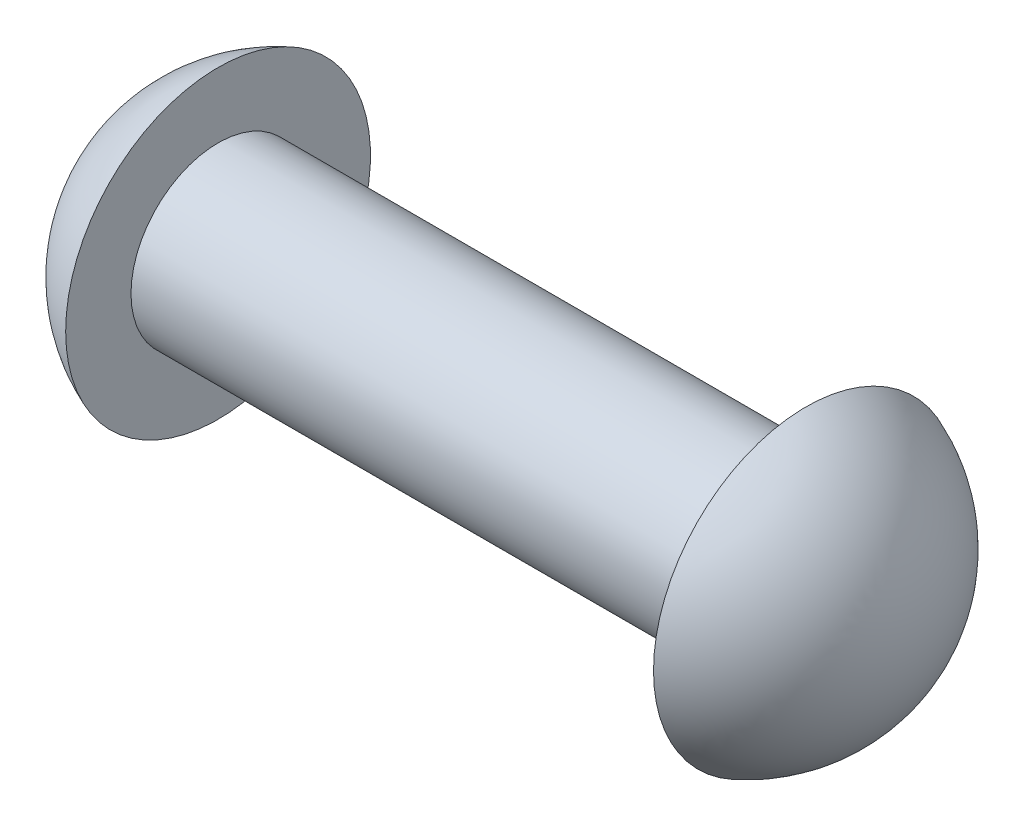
ISO-10303-21;
HEADER;
FILE_DESCRIPTION(('STEP AP214'),'2;1');
FILE_NAME('part.step','',(''),(''),'','','');
FILE_SCHEMA(('AUTOMOTIVE_DESIGN { 1 0 10303 214 1 1 1 1 }'));
ENDSEC;
DATA;
#1=APPLICATION_CONTEXT('core data for automotive mechanical design processes');
#2=APPLICATION_PROTOCOL_DEFINITION('international standard','automotive_design',2000,#1);
#3=PRODUCT_CONTEXT('',#1,'mechanical');
#4=PRODUCT('Part','Part','',(#3));
#5=PRODUCT_RELATED_PRODUCT_CATEGORY('part','',(#4));
#6=PRODUCT_DEFINITION_FORMATION('','',#4);
#7=PRODUCT_DEFINITION_CONTEXT('part definition',#1,'design');
#8=PRODUCT_DEFINITION('design','',#6,#7);
#9=PRODUCT_DEFINITION_SHAPE('','',#8);
#10=(LENGTH_UNIT() NAMED_UNIT(*) SI_UNIT(.MILLI.,.METRE.));
#11=(NAMED_UNIT(*) PLANE_ANGLE_UNIT() SI_UNIT($,.RADIAN.));
#12=(NAMED_UNIT(*) SI_UNIT($,.STERADIAN.) SOLID_ANGLE_UNIT());
#13=UNCERTAINTY_MEASURE_WITH_UNIT(LENGTH_MEASURE(1.E-05),#10,'distance_accuracy_value','');
#14=(GEOMETRIC_REPRESENTATION_CONTEXT(3) GLOBAL_UNCERTAINTY_ASSIGNED_CONTEXT((#13)) GLOBAL_UNIT_ASSIGNED_CONTEXT((#10,
#11,#12)) REPRESENTATION_CONTEXT('',''));
#15=CARTESIAN_POINT('',(0.,0.,0.));
#16=DIRECTION('',(0.,0.,1.));
#17=DIRECTION('',(1.,0.,0.));
#18=AXIS2_PLACEMENT_3D('',#15,#16,#17);
#19=CARTESIAN_POINT('',(-39.,0.,0.));
#20=DIRECTION('',(-1.,0.,0.));
#21=DIRECTION('',(0.,0.,1.));
#22=AXIS2_PLACEMENT_3D('',#19,#20,#21);
#23=CYLINDRICAL_SURFACE('',#22,4.);
#24=CARTESIAN_POINT('',(-27.,0.,0.));
#25=DIRECTION('',(-1.,0.,0.));
#26=DIRECTION('',(0.,0.,1.));
#27=AXIS2_PLACEMENT_3D('',#24,#25,#26);
#28=CIRCLE('',#27,4.);
#29=CARTESIAN_POINT('',(-27.,0.,4.));
#30=VERTEX_POINT('',#29);
#31=EDGE_CURVE('E11',#30,#30,#28,.T.);
#32=ORIENTED_EDGE('',*,*,#31,.F.);
#33=EDGE_LOOP('',(#32));
#34=FACE_BOUND('',#33,.T.);
#35=CARTESIAN_POINT('',(0.,0.,0.));
#36=DIRECTION('',(1.,0.,0.));
#37=DIRECTION('',(0.,0.,-1.));
#38=AXIS2_PLACEMENT_3D('',#35,#36,#37);
#39=CIRCLE('',#38,4.);
#40=CARTESIAN_POINT('',(0.,0.,-4.));
#41=VERTEX_POINT('',#40);
#42=EDGE_CURVE('E68',#41,#41,#39,.T.);
#43=ORIENTED_EDGE('',*,*,#42,.F.);
#44=EDGE_LOOP('',(#43));
#45=FACE_BOUND('',#44,.T.);
#46=ADVANCED_FACE('F32',(#34,#45),#23,.T.);
#47=CARTESIAN_POINT('',(-27.,4.,0.));
#48=DIRECTION('',(-1.,0.,0.));
#49=DIRECTION('',(0.,0.,1.));
#50=AXIS2_PLACEMENT_3D('',#47,#48,#49);
#51=PLANE('',#50);
#52=CARTESIAN_POINT('',(-27.,0.,0.));
#53=DIRECTION('',(-1.,0.,0.));
#54=DIRECTION('',(0.,0.,1.));
#55=AXIS2_PLACEMENT_3D('',#52,#53,#54);
#56=CIRCLE('',#55,7.);
#57=CARTESIAN_POINT('',(-27.,0.,7.));
#58=VERTEX_POINT('',#57);
#59=EDGE_CURVE('E39',#58,#58,#56,.T.);
#60=ORIENTED_EDGE('',*,*,#59,.F.);
#61=EDGE_LOOP('',(#60));
#62=FACE_BOUND('',#61,.T.);
#63=ORIENTED_EDGE('',*,*,#31,.T.);
#64=EDGE_LOOP('',(#63));
#65=FACE_BOUND('',#64,.T.);
#66=ADVANCED_FACE('F58',(#62,#65),#51,.F.);
#67=CARTESIAN_POINT('',(-24.3000005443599,0.,0.00285751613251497));
#68=DIRECTION('',(0.,-1.,0.));
#69=DIRECTION('',(0.,0.,1.));
#70=AXIS2_PLACEMENT_3D('',#67,#68,#69);
#71=CIRCLE('',#70,7.5);
#72=TRIMMED_CURVE('',#71,(PARAMETER_VALUE(-1.57117732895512)),
(PARAMETER_VALUE(1.57117732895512)),.T.,.PARAMETER.);
#73=CARTESIAN_POINT('',(-24.3000005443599,0.,0.));
#74=DIRECTION('',(-1.,0.,0.));
#75=AXIS1_PLACEMENT('',#73,#74);
#76=SURFACE_OF_REVOLUTION('',#72,#75);
#77=CARTESIAN_POINT('',(-31.8,0.,0.));
#78=VERTEX_POINT('',#77);
#79=VERTEX_LOOP('',#78);
#80=FACE_BOUND('',#79,.T.);
#81=ORIENTED_EDGE('',*,*,#59,.T.);
#82=EDGE_LOOP('',(#81));
#83=FACE_BOUND('',#82,.T.);
#84=ADVANCED_FACE('F53',(#80,#83),#76,.T.);
#85=CARTESIAN_POINT('',(0.,0.,0.));
#86=DIRECTION('',(1.,0.,0.));
#87=DIRECTION('',(0.,0.,-1.));
#88=AXIS2_PLACEMENT_3D('',#85,#86,#87);
#89=PLANE('',#88);
#90=ORIENTED_EDGE('',*,*,#42,.T.);
#91=EDGE_LOOP('',(#90));
#92=FACE_BOUND('',#91,.T.);
#93=CARTESIAN_POINT('',(0.,0.,0.));
#94=DIRECTION('',(-1.,0.,0.));
#95=DIRECTION('',(0.,0.,1.));
#96=AXIS2_PLACEMENT_3D('',#93,#94,#95);
#97=CIRCLE('',#96,7.);
#98=CARTESIAN_POINT('',(0.,0.,7.));
#99=VERTEX_POINT('',#98);
#100=EDGE_CURVE('E69',#99,#99,#97,.T.);
#101=ORIENTED_EDGE('',*,*,#100,.T.);
#102=EDGE_LOOP('',(#101));
#103=FACE_BOUND('',#102,.T.);
#104=ADVANCED_FACE('F47',(#92,#103),#89,.F.);
#105=CARTESIAN_POINT('',(-2.69999945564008,0.,0.00285751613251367));
#106=DIRECTION('',(0.,-1.,0.));
#107=DIRECTION('',(0.,0.,1.));
#108=AXIS2_PLACEMENT_3D('',#105,#106,#107);
#109=CIRCLE('',#108,7.5);
#110=TRIMMED_CURVE('',#109,(PARAMETER_VALUE(-1.57117732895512)),
(PARAMETER_VALUE(1.57117732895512)),.T.,.PARAMETER.);
#111=CARTESIAN_POINT('',(-2.69999945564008,0.,0.));
#112=DIRECTION('',(-1.,0.,0.));
#113=AXIS1_PLACEMENT('',#111,#112);
#114=SURFACE_OF_REVOLUTION('',#110,#113);
#115=ORIENTED_EDGE('',*,*,#100,.F.);
#116=EDGE_LOOP('',(#115));
#117=FACE_BOUND('',#116,.T.);
#118=CARTESIAN_POINT('',(4.8,0.,0.));
#119=VERTEX_POINT('',#118);
#120=VERTEX_LOOP('',#119);
#121=FACE_BOUND('',#120,.T.);
#122=ADVANCED_FACE('F45',(#117,#121),#114,.T.);
#123=CLOSED_SHELL('',(#46,#66,#84,#104,#122));
#124=MANIFOLD_SOLID_BREP('B2',#123);
#125=ADVANCED_BREP_SHAPE_REPRESENTATION('',(#18,#124),#14);
#126=SHAPE_DEFINITION_REPRESENTATION(#9,#125);
ENDSEC;
END-ISO-10303-21;
